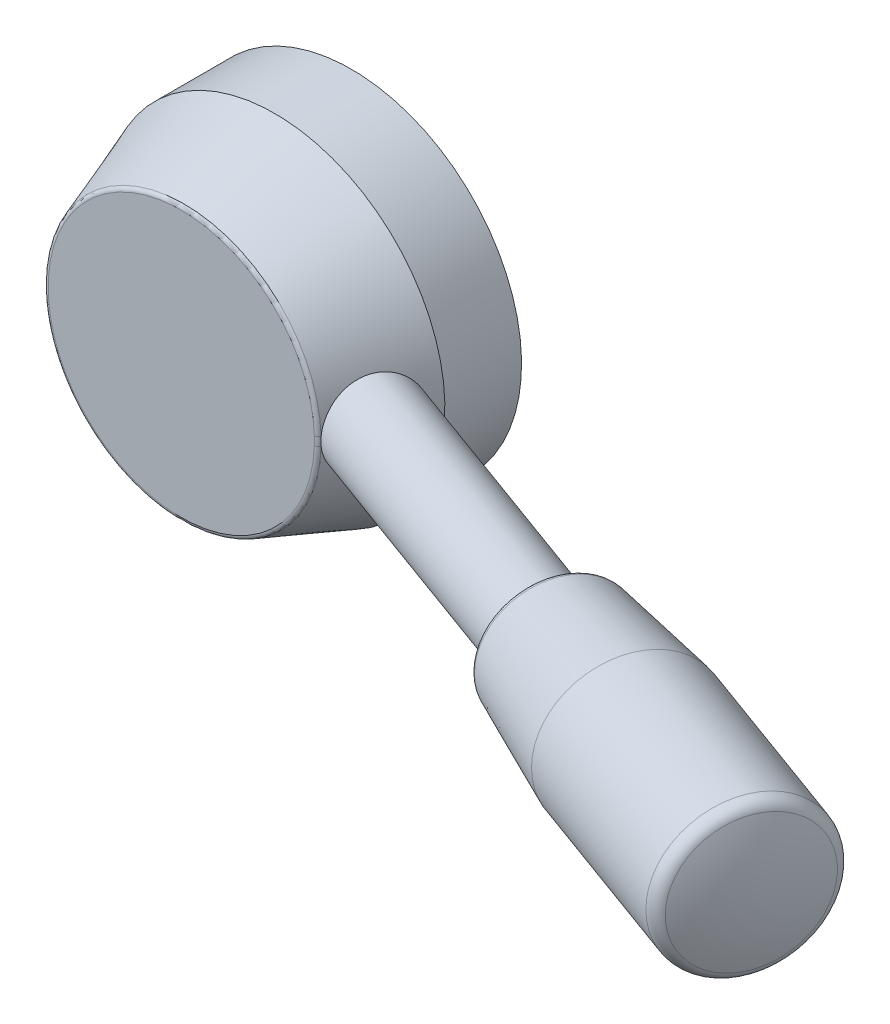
ISO-10303-21;
HEADER;
FILE_DESCRIPTION(('STEP AP214'),'2;1');
FILE_NAME('part.step','',(''),(''),'','','');
FILE_SCHEMA(('AUTOMOTIVE_DESIGN { 1 0 10303 214 1 1 1 1 }'));
ENDSEC;
DATA;
#1=APPLICATION_CONTEXT('core data for automotive mechanical design processes');
#2=APPLICATION_PROTOCOL_DEFINITION('international standard','automotive_design',2000,#1);
#3=PRODUCT_CONTEXT('',#1,'mechanical');
#4=PRODUCT('Part','Part','',(#3));
#5=PRODUCT_RELATED_PRODUCT_CATEGORY('part','',(#4));
#6=PRODUCT_DEFINITION_FORMATION('','',#4);
#7=PRODUCT_DEFINITION_CONTEXT('part definition',#1,'design');
#8=PRODUCT_DEFINITION('design','',#6,#7);
#9=PRODUCT_DEFINITION_SHAPE('','',#8);
#10=(LENGTH_UNIT() NAMED_UNIT(*) SI_UNIT(.MILLI.,.METRE.));
#11=(NAMED_UNIT(*) PLANE_ANGLE_UNIT() SI_UNIT($,.RADIAN.));
#12=(NAMED_UNIT(*) SI_UNIT($,.STERADIAN.) SOLID_ANGLE_UNIT());
#13=UNCERTAINTY_MEASURE_WITH_UNIT(LENGTH_MEASURE(1.E-05),#10,'distance_accuracy_value','');
#14=(GEOMETRIC_REPRESENTATION_CONTEXT(3) GLOBAL_UNCERTAINTY_ASSIGNED_CONTEXT((#13)) GLOBAL_UNIT_ASSIGNED_CONTEXT((#10,
#11,#12)) REPRESENTATION_CONTEXT('',''));
#15=CARTESIAN_POINT('',(0.,0.,0.));
#16=DIRECTION('',(0.,0.,1.));
#17=DIRECTION('',(1.,0.,0.));
#18=AXIS2_PLACEMENT_3D('',#15,#16,#17);
#19=CARTESIAN_POINT('',(0.,0.,19.3420201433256));
#20=DIRECTION('',(0.,0.,-1.));
#21=DIRECTION('',(0.,1.,0.));
#22=AXIS2_PLACEMENT_3D('',#19,#20,#21);
#23=CONICAL_SURFACE('',#22,16.2394850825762,0.349065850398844);
#24=CARTESIAN_POINT('',(0.,0.,9.01009032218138));
#25=DIRECTION('',(0.,0.,1.));
#26=DIRECTION('',(0.,-1.,0.));
#27=AXIS2_PLACEMENT_3D('',#24,#25,#26);
#28=CIRCLE('',#27,20.);
#29=CARTESIAN_POINT('',(0.,-20.,9.01009032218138));
#30=VERTEX_POINT('',#29);
#31=EDGE_CURVE('E144',#30,#30,#28,.T.);
#32=ORIENTED_EDGE('',*,*,#31,.T.);
#33=EDGE_LOOP('',(#32));
#34=FACE_BOUND('',#33,.T.);
#35=CARTESIAN_POINT('',(18.8096263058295,3.38928122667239,11.4483606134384));
#36=CARTESIAN_POINT('',(18.7106112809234,3.59614483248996,11.6153012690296));
#37=CARTESIAN_POINT('',(18.6046550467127,3.78684364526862,11.7982940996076));
#38=CARTESIAN_POINT('',(18.3843331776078,4.13075217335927,12.1924584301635));
#39=CARTESIAN_POINT('',(18.2699630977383,4.28394188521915,12.4036448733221));
#40=CARTESIAN_POINT('',(18.0385177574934,4.54850790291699,12.8497150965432));
#41=CARTESIAN_POINT('',(17.9214407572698,4.65985647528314,13.0846144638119));
#42=CARTESIAN_POINT('',(17.6904441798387,4.83706101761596,13.5724031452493));
#43=CARTESIAN_POINT('',(17.5765237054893,4.90293004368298,13.8252872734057));
#44=CARTESIAN_POINT('',(17.3591470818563,4.98612783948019,14.3376834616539));
#45=CARTESIAN_POINT('',(17.255537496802,5.00432349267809,14.596989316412));
#46=CARTESIAN_POINT('',(17.0605799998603,4.99394605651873,15.1192309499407));
#47=CARTESIAN_POINT('',(16.9692302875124,4.96537984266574,15.3821661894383));
#48=CARTESIAN_POINT('',(16.8035502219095,4.86373578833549,15.8972647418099));
#49=CARTESIAN_POINT('',(16.7288532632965,4.79178201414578,16.1495333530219));
#50=CARTESIAN_POINT('',(16.5945661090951,4.60665437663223,16.6426924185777));
#51=CARTESIAN_POINT('',(16.5349772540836,4.49347685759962,16.8835818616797));
#52=CARTESIAN_POINT('',(16.4296976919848,4.22751597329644,17.350119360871));
#53=CARTESIAN_POINT('',(16.3842022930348,4.07422605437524,17.575522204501));
#54=CARTESIAN_POINT('',(16.3064906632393,3.73297458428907,18.0009701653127));
#55=CARTESIAN_POINT('',(16.2742774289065,3.54500522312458,18.2010095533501));
#56=CARTESIAN_POINT('',(16.2198686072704,3.13232504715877,18.5758556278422));
#57=CARTESIAN_POINT('',(16.1980421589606,2.90659951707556,18.7496007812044));
#58=CARTESIAN_POINT('',(16.1631824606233,2.42898195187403,19.0575568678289));
#59=CARTESIAN_POINT('',(16.1501490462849,2.17709040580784,19.1917685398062));
#60=CARTESIAN_POINT('',(16.1302714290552,1.65434636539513,19.4152433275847));
#61=CARTESIAN_POINT('',(16.1234161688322,1.38352868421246,19.5045866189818));
#62=CARTESIAN_POINT('',(16.1139084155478,0.830419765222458,19.6347431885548));
#63=CARTESIAN_POINT('',(16.1112547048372,0.548131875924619,19.6755705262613));
#64=CARTESIAN_POINT('',(16.1092377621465,-0.00891456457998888,19.7062401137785));
#65=CARTESIAN_POINT('',(16.1097587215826,-0.283575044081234,19.6978771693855));
#66=CARTESIAN_POINT('',(16.1140091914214,-0.827456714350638,19.634717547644));
#67=CARTESIAN_POINT('',(16.1177385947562,-1.09667808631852,19.5799224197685));
#68=CARTESIAN_POINT('',(16.1295104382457,-1.6194157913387,19.4270534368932));
#69=CARTESIAN_POINT('',(16.1375088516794,-1.8730634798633,19.3294231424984));
#70=CARTESIAN_POINT('',(16.1596753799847,-2.36112466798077,19.0947485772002));
#71=CARTESIAN_POINT('',(16.1738446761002,-2.59553447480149,18.9576967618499));
#72=CARTESIAN_POINT('',(16.2113006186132,-3.04672110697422,18.6438181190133));
#73=CARTESIAN_POINT('',(16.2348694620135,-3.26267385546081,18.4658401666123));
#74=CARTESIAN_POINT('',(16.2937987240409,-3.66266387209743,18.0786596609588));
#75=CARTESIAN_POINT('',(16.3291610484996,-3.84669597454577,17.8694520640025));
#76=CARTESIAN_POINT('',(16.4150442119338,-4.18177206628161,17.4211489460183));
#77=CARTESIAN_POINT('',(16.4658920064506,-4.33196910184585,17.1814811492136));
#78=CARTESIAN_POINT('',(16.5840742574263,-4.58927420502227,16.6837804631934));
#79=CARTESIAN_POINT('',(16.6514054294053,-4.69639084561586,16.4257512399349));
#80=CARTESIAN_POINT('',(16.8009614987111,-4.86200191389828,15.9056427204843));
#81=CARTESIAN_POINT('',(16.8828079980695,-4.9215585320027,15.6437932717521));
#82=CARTESIAN_POINT('',(17.0608043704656,-4.99404706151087,15.1185268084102));
#83=CARTESIAN_POINT('',(17.1569519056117,-5.00698658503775,14.8551100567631));
#84=CARTESIAN_POINT('',(17.3574833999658,-4.98617572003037,14.3417740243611));
#85=CARTESIAN_POINT('',(17.4615652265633,-4.95370942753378,14.0916829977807));
#86=CARTESIAN_POINT('',(17.6760495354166,-4.84552718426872,13.6038882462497));
#87=CARTESIAN_POINT('',(17.7864524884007,-4.76980800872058,13.3661854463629));
#88=CARTESIAN_POINT('',(18.010054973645,-4.57635477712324,12.9060550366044));
#89=CARTESIAN_POINT('',(18.1232721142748,-4.4581392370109,12.6838388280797));
#90=CARTESIAN_POINT('',(18.3459937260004,-4.1832267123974,12.2625448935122));
#91=CARTESIAN_POINT('',(18.4554975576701,-4.02652313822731,12.063471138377));
#92=CARTESIAN_POINT('',(18.6687487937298,-3.67347260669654,11.6869264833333));
#93=CARTESIAN_POINT('',(18.7722241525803,-3.47607542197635,11.5102850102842));
#94=CARTESIAN_POINT('',(18.9643378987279,-3.04998444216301,11.1896616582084));
#95=CARTESIAN_POINT('',(19.0529755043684,-2.82128899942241,11.0456814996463));
#96=CARTESIAN_POINT('',(19.2110746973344,-2.33723383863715,10.7929308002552));
#97=CARTESIAN_POINT('',(19.2804200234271,-2.08172471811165,10.6843730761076));
#98=CARTESIAN_POINT('',(19.3952123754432,-1.55236166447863,10.5064174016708));
#99=CARTESIAN_POINT('',(19.4406634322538,-1.27851083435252,10.4370128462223));
#100=CARTESIAN_POINT('',(19.5042063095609,-0.726830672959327,10.3403592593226));
#101=CARTESIAN_POINT('',(19.5228910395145,-0.449229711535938,10.3121963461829));
#102=CARTESIAN_POINT('',(19.5336983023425,0.107669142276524,10.2958804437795));
#103=CARTESIAN_POINT('',(19.5258217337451,0.386966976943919,10.3077261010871));
#104=CARTESIAN_POINT('',(19.4843554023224,0.9341592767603,10.3705257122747));
#105=CARTESIAN_POINT('',(19.4512176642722,1.20216774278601,10.4207922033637));
#106=CARTESIAN_POINT('',(19.3616577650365,1.7243639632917,10.5582819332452));
#107=CARTESIAN_POINT('',(19.3052439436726,1.97855663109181,10.6454919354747));
#108=CARTESIAN_POINT('',(19.1807931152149,2.43506808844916,10.8412429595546));
#109=CARTESIAN_POINT('',(19.1151765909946,2.63985774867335,10.945610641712));
#110=CARTESIAN_POINT('',(18.9712185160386,3.0300021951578,11.1789884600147));
#111=CARTESIAN_POINT('',(18.8928757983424,3.21535519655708,11.3080008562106));
#112=CARTESIAN_POINT('',(18.8096263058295,3.38928122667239,11.4483606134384));
#113=B_SPLINE_CURVE_WITH_KNOTS('',3,(#35,#36,#37,#38,#39,#40,#41,#42,#43,#44,#45,#46,#47,#48,
#49,#50,#51,#52,#53,#54,#55,#56,#57,#58,#59,#60,#61,#62,#63,#64,#65,#66,#67,#68,#69,#70,#71,#72,
#73,#74,#75,#76,#77,#78,#79,#80,#81,#82,#83,#84,#85,#86,#87,#88,#89,#90,#91,#92,#93,#94,#95,#96,
#97,#98,#99,#100,#101,#102,#103,#104,#105,#106,#107,#108,#109,#110,#111,#112),.UNSPECIFIED.,.T.,
.F.,(4,2,2,2,2,2,2,2,2,2,2,2,2,2,2,2,2,2,2,2,2,2,2,2,2,2,2,2,2,2,2,2,2,2,2,2,2,2,4),(0.,
0.850150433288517,1.70075326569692,2.55191891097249,3.40284010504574,4.23817734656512,
5.07339177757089,5.88784545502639,6.70237137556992,7.52772639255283,8.35326751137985,
9.2062876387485,10.0592918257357,10.9107663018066,11.7619939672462,12.5823602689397,
13.4026991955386,14.2147368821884,15.026930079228,15.8656037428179,16.7044130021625,
17.5623300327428,18.4200762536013,19.2580836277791,20.0959541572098,20.9106026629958,
21.7253119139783,22.5495588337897,23.3739469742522,24.223120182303,25.0723381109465,
25.926567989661,26.7806537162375,27.6155111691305,28.4503403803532,29.2705719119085,
30.0905098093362,30.8052306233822,31.5200170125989),.UNSPECIFIED.);
#114=CARTESIAN_POINT('',(16.111567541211,-0.513313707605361,19.6710100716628));
#115=VERTEX_POINT('',#114);
#116=CARTESIAN_POINT('',(16.111567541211,0.513313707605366,19.6710100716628));
#117=VERTEX_POINT('',#116);
#118=EDGE_CURVE('E145',#115,#117,#113,.T.);
#119=ORIENTED_EDGE('',*,*,#118,.F.);
#120=CARTESIAN_POINT('',(0.,0.,19.6710100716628));
#121=DIRECTION('',(0.,0.,-1.));
#122=DIRECTION('',(0.,1.,0.));
#123=AXIS2_PLACEMENT_3D('',#120,#121,#122);
#124=CIRCLE('',#123,16.1197425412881);
#125=EDGE_CURVE('E9',#115,#117,#124,.T.);
#126=ORIENTED_EDGE('',*,*,#125,.T.);
#127=EDGE_LOOP('',(#119,#126));
#128=FACE_BOUND('',#127,.T.);
#129=ADVANCED_FACE('F14',(#34,#128),#23,.T.);
#130=CARTESIAN_POINT('',(-4.,0.,13.));
#131=DIRECTION('',(0.,0.,-1.));
#132=DIRECTION('',(0.,1.,0.));
#133=AXIS2_PLACEMENT_3D('',#130,#131,#132);
#134=PLANE('',#133);
#135=CARTESIAN_POINT('',(0.,0.,13.));
#136=DIRECTION('',(0.,0.,1.));
#137=DIRECTION('',(0.,-1.,0.));
#138=AXIS2_PLACEMENT_3D('',#135,#136,#137);
#139=CIRCLE('',#138,4.);
#140=CARTESIAN_POINT('',(0.,-4.,13.));
#141=VERTEX_POINT('',#140);
#142=EDGE_CURVE('E147',#141,#141,#139,.T.);
#143=ORIENTED_EDGE('',*,*,#142,.F.);
#144=EDGE_LOOP('',(#143));
#145=FACE_BOUND('',#144,.T.);
#146=ADVANCED_FACE('F135',(#145),#134,.T.);
#147=CARTESIAN_POINT('',(0.,0.,25.));
#148=DIRECTION('',(0.,0.,1.));
#149=DIRECTION('',(0.,-1.,0.));
#150=AXIS2_PLACEMENT_3D('',#147,#148,#149);
#151=CYLINDRICAL_SURFACE('',#150,4.);
#152=CARTESIAN_POINT('',(0.,0.,0.));
#153=DIRECTION('',(0.,0.,1.));
#154=DIRECTION('',(0.,-1.,0.));
#155=AXIS2_PLACEMENT_3D('',#152,#153,#154);
#156=CIRCLE('',#155,4.);
#157=CARTESIAN_POINT('',(0.,-4.,0.));
#158=VERTEX_POINT('',#157);
#159=EDGE_CURVE('E154',#158,#158,#156,.T.);
#160=ORIENTED_EDGE('',*,*,#159,.F.);
#161=EDGE_LOOP('',(#160));
#162=FACE_BOUND('',#161,.T.);
#163=ORIENTED_EDGE('',*,*,#142,.T.);
#164=EDGE_LOOP('',(#163));
#165=FACE_BOUND('',#164,.T.);
#166=ADVANCED_FACE('F140',(#162,#165),#151,.F.);
#167=CARTESIAN_POINT('',(-20.,0.,0.));
#168=DIRECTION('',(0.,0.,-1.));
#169=DIRECTION('',(0.,1.,0.));
#170=AXIS2_PLACEMENT_3D('',#167,#168,#169);
#171=PLANE('',#170);
#172=ORIENTED_EDGE('',*,*,#159,.T.);
#173=EDGE_LOOP('',(#172));
#174=FACE_BOUND('',#173,.T.);
#175=CARTESIAN_POINT('',(0.,0.,0.));
#176=DIRECTION('',(0.,0.,1.));
#177=DIRECTION('',(0.,-1.,0.));
#178=AXIS2_PLACEMENT_3D('',#175,#176,#177);
#179=CIRCLE('',#178,20.);
#180=CARTESIAN_POINT('',(0.,-20.,0.));
#181=VERTEX_POINT('',#180);
#182=EDGE_CURVE('E157',#181,#181,#179,.T.);
#183=ORIENTED_EDGE('',*,*,#182,.F.);
#184=EDGE_LOOP('',(#183));
#185=FACE_BOUND('',#184,.T.);
#186=ADVANCED_FACE('F188',(#174,#185),#171,.T.);
#187=CARTESIAN_POINT('',(0.,0.,25.));
#188=DIRECTION('',(0.,0.,1.));
#189=DIRECTION('',(0.,-1.,0.));
#190=AXIS2_PLACEMENT_3D('',#187,#188,#189);
#191=CYLINDRICAL_SURFACE('',#190,20.);
#192=ORIENTED_EDGE('',*,*,#182,.T.);
#193=EDGE_LOOP('',(#192));
#194=FACE_BOUND('',#193,.T.);
#195=ORIENTED_EDGE('',*,*,#31,.F.);
#196=EDGE_LOOP('',(#195));
#197=FACE_BOUND('',#196,.T.);
#198=ADVANCED_FACE('F66',(#194,#197),#191,.T.);
#199=CARTESIAN_POINT('',(-15.2997924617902,0.,20.));
#200=DIRECTION('',(0.,0.,1.));
#201=DIRECTION('',(0.,-1.,0.));
#202=AXIS2_PLACEMENT_3D('',#199,#200,#201);
#203=PLANE('',#202);
#204=CARTESIAN_POINT('',(0.,0.,20.));
#205=DIRECTION('',(0.,0.,1.));
#206=DIRECTION('',(0.,-1.,0.));
#207=AXIS2_PLACEMENT_3D('',#204,#205,#206);
#208=CIRCLE('',#207,15.6498962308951);
#209=CARTESIAN_POINT('',(15.641959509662,0.498352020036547,20.));
#210=VERTEX_POINT('',#209);
#211=CARTESIAN_POINT('',(15.641959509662,-0.498352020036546,20.));
#212=VERTEX_POINT('',#211);
#213=EDGE_CURVE('E50',#210,#212,#208,.T.);
#214=ORIENTED_EDGE('',*,*,#213,.T.);
#215=CARTESIAN_POINT('',(16.177433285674,2.64587121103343,20.));
#216=CARTESIAN_POINT('',(16.1550419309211,2.2603785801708,20.));
#217=CARTESIAN_POINT('',(16.1493813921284,2.16292596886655,19.6264000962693));
#218=CARTESIAN_POINT('',(16.1437208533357,2.06547335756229,19.2528001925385));
#219=CARTESIAN_POINT('',(16.1632502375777,2.40169391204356,19.0639079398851));
#220=CARTESIAN_POINT('',(16.1700840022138,2.64629949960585,20.));
#221=CARTESIAN_POINT('',(16.1592972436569,2.26011994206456,20.));
#222=CARTESIAN_POINT('',(16.1565700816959,2.16249610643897,19.6263986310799));
#223=CARTESIAN_POINT('',(16.1538425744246,2.06487308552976,19.2527975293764));
#224=CARTESIAN_POINT('',(16.1632503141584,2.40169500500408,19.0639072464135));
#225=CARTESIAN_POINT('',(16.162719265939,2.64639253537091,20.));
#226=CARTESIAN_POINT('',(16.1635621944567,2.26018210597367,20.));
#227=CARTESIAN_POINT('',(16.1637707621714,2.16244960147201,19.626527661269));
#228=CARTESIAN_POINT('',(16.1639764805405,2.0647171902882,19.2530552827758));
#229=CARTESIAN_POINT('',(16.1632369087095,2.40146427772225,19.0640369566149));
#230=CARTESIAN_POINT('',(16.1480170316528,2.6459217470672,20.));
#231=CARTESIAN_POINT('',(16.171844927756,2.26086969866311,20.));
#232=CARTESIAN_POINT('',(16.177894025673,2.16303996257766,19.6270337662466));
#233=CARTESIAN_POINT('',(16.1839402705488,2.06520989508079,19.2540673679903));
#234=CARTESIAN_POINT('',(16.1631839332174,2.4005510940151,19.0645498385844));
#235=CARTESIAN_POINT('',(16.1406795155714,2.64535849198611,20.));
#236=CARTESIAN_POINT('',(16.1758613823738,2.2614942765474,20.));
#237=CARTESIAN_POINT('',(16.1848168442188,2.16367623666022,19.6274106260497));
#238=CARTESIAN_POINT('',(16.1937665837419,2.06585737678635,19.2548208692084));
#239=CARTESIAN_POINT('',(16.1631443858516,2.39986902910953,19.0649327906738));
#240=CARTESIAN_POINT('',(16.118912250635,2.64272149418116,20.));
#241=CARTESIAN_POINT('',(16.187075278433,2.26407541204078,20.));
#242=CARTESIAN_POINT('',(16.204611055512,2.1664669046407,19.6288846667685));
#243=CARTESIAN_POINT('',(16.2221272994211,2.06885566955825,19.2577677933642));
#244=CARTESIAN_POINT('',(16.1629886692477,2.39717992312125,19.0664413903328));
#245=CARTESIAN_POINT('',(16.1045885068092,2.63970789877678,20.));
#246=CARTESIAN_POINT('',(16.1935295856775,2.26673520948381,20.));
#247=CARTESIAN_POINT('',(16.2166535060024,2.16949832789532,19.630325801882));
#248=CARTESIAN_POINT('',(16.2397488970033,2.07225088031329,19.2606463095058));
#249=CARTESIAN_POINT('',(16.1628353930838,2.39452947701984,19.0679270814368));
#250=CARTESIAN_POINT('',(16.0766576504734,2.63148099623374,20.));
#251=CARTESIAN_POINT('',(16.2032793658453,2.27266571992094,20.));
#252=CARTESIAN_POINT('',(16.2371338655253,2.17654355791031,19.633916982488));
#253=CARTESIAN_POINT('',(16.2709587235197,2.08041194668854,19.2678290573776));
#254=CARTESIAN_POINT('',(16.1624445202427,2.38773374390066,19.0717234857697));
#255=CARTESIAN_POINT('',(16.0630484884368,2.62627441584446,20.));
#256=CARTESIAN_POINT('',(16.2065878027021,2.27592949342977,20.));
#257=CARTESIAN_POINT('',(16.2455826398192,2.18055434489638,19.6360648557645));
#258=CARTESIAN_POINT('',(16.2845528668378,2.08516515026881,19.2721208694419));
#259=CARTESIAN_POINT('',(16.1622071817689,2.38359303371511,19.0740316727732));
#260=CARTESIAN_POINT('',(16.0366638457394,2.61402081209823,20.));
#261=CARTESIAN_POINT('',(16.2100965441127,2.28185394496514,20.));
#262=CARTESIAN_POINT('',(16.2588824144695,2.18824976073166,19.6408438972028));
#263=CARTESIAN_POINT('',(16.3076431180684,2.09463082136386,19.2816787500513));
#264=CARTESIAN_POINT('',(16.1616642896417,2.37405515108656,19.0793252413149));
#265=CARTESIAN_POINT('',(16.0238903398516,2.60696961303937,20.));
#266=CARTESIAN_POINT('',(16.2103001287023,2.28451338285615,20.));
#267=CARTESIAN_POINT('',(16.263725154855,2.19193362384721,19.6434761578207));
#268=CARTESIAN_POINT('',(16.3171369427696,2.09933996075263,19.2869399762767));
#269=CARTESIAN_POINT('',(16.1613585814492,2.36865513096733,19.0823121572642));
#270=CARTESIAN_POINT('',(15.990753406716,2.58602250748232,20.));
#271=CARTESIAN_POINT('',(16.2074330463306,2.28981251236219,20.));
#272=CARTESIAN_POINT('',(16.2726604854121,2.20025223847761,19.6509463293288));
#273=CARTESIAN_POINT('',(16.3378455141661,2.11065513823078,19.3018593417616));
#274=CARTESIAN_POINT('',(16.1604664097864,2.35276355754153,19.0910563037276));
#275=CARTESIAN_POINT('',(15.9712519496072,2.57076588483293,20.));
#276=CARTESIAN_POINT('',(16.2020369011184,2.29119913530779,20.));
#277=CARTESIAN_POINT('',(16.2739168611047,2.20378199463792,19.6560504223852));
#278=CARTESIAN_POINT('',(16.3458073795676,2.11635841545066,19.3120605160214));
#279=CARTESIAN_POINT('',(16.1598320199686,2.34133393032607,19.097300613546));
#280=CARTESIAN_POINT('',(15.9348221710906,2.53743449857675,20.));
#281=CARTESIAN_POINT('',(16.1873196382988,2.28903716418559,20.));
#282=CARTESIAN_POINT('',(16.2712327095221,2.20616242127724,19.6664726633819));
#283=CARTESIAN_POINT('',(16.3551563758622,2.12327537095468,19.3329035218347));
#284=CARTESIAN_POINT('',(16.1584752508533,2.31645907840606,19.1107416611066));
#285=CARTESIAN_POINT('',(15.9179019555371,2.51935120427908,20.));
#286=CARTESIAN_POINT('',(16.1780185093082,2.28551235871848,20.));
#287=CARTESIAN_POINT('',(16.2672761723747,2.20499865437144,19.6717914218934));
#288=CARTESIAN_POINT('',(16.356574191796,2.1245099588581,19.3435415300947));
#289=CARTESIAN_POINT('',(16.1577526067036,2.3030077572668,19.1179412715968));
#290=CARTESIAN_POINT('',(15.8883636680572,2.48374855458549,20.));
#291=CARTESIAN_POINT('',(16.159064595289,2.27492674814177,20.));
#292=CARTESIAN_POINT('',(16.2573455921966,2.19891496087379,19.6816887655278));
#293=CARTESIAN_POINT('',(16.3556590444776,2.12292280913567,19.3633461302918));
#294=CARTESIAN_POINT('',(16.1563551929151,2.27649251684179,19.1319615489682));
#295=CARTESIAN_POINT('',(15.8754721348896,2.46645199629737,20.));
#296=CARTESIAN_POINT('',(16.1496242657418,2.26840224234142,20.));
#297=CARTESIAN_POINT('',(16.2516936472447,2.19449359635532,19.6862751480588));
#298=CARTESIAN_POINT('',(16.353803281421,2.12062245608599,19.3725206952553));
#299=CARTESIAN_POINT('',(16.1556860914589,2.26359842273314,19.1387132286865));
#300=CARTESIAN_POINT('',(15.8512251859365,2.43080637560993,20.));
#301=CARTESIAN_POINT('',(16.1303522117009,2.25266668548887,20.));
#302=CARTESIAN_POINT('',(16.2393226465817,2.1829532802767,19.6953169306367));
#303=CARTESIAN_POINT('',(16.3483337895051,2.11327789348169,19.3906042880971));
#304=CARTESIAN_POINT('',(16.154327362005,2.2369480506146,19.1525117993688));
#305=CARTESIAN_POINT('',(15.8398709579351,2.41245651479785,20.));
#306=CARTESIAN_POINT('',(16.1205201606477,2.24346896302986,20.));
#307=CARTESIAN_POINT('',(16.2326027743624,2.17583225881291,19.6997722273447));
#308=CARTESIAN_POINT('',(16.3447294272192,2.10824846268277,19.3995172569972));
#309=CARTESIAN_POINT('',(16.153637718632,2.22319111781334,19.1595589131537));
#310=CARTESIAN_POINT('',(15.8078114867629,2.35624800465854,20.));
#311=CARTESIAN_POINT('',(16.0913048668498,2.21274573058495,20.));
#312=CARTESIAN_POINT('',(16.2118018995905,2.15116947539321,19.7128863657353));
#313=CARTESIAN_POINT('',(16.3324683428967,2.08979271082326,19.4256648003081));
#314=CARTESIAN_POINT('',(16.151555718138,2.18087428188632,19.1809775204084));
#315=CARTESIAN_POINT('',(15.7891187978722,2.317242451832,20.));
#316=CARTESIAN_POINT('',(16.0720059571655,2.18796338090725,20.));
#317=CARTESIAN_POINT('',(16.1970838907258,2.13033066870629,19.7212901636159));
#318=CARTESIAN_POINT('',(16.3223176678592,2.07295746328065,19.4424918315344));
#319=CARTESIAN_POINT('',(16.1501507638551,2.15127723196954,19.1956215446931));
#320=CARTESIAN_POINT('',(15.7553432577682,2.23613437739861,20.));
#321=CARTESIAN_POINT('',(16.0349935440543,2.13194189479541,20.));
#322=CARTESIAN_POINT('',(16.1677763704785,2.08197012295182,19.7376362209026));
#323=CARTESIAN_POINT('',(16.3007318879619,2.0322809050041,19.4751777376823));
#324=CARTESIAN_POINT('',(16.1473145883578,2.08904251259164,19.2256064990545));
#325=CARTESIAN_POINT('',(15.7404129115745,2.19397101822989,20.));
#326=CARTESIAN_POINT('',(16.0173034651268,2.10052193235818,20.));
#327=CARTESIAN_POINT('',(16.1532101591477,2.05423656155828,19.7455513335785));
#328=CARTESIAN_POINT('',(16.2892564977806,2.00825169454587,19.4910264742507));
#329=CARTESIAN_POINT('',(16.1458842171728,2.05633404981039,19.2409536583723));
#330=CARTESIAN_POINT('',(15.7140980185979,2.10851673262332,20.));
#331=CARTESIAN_POINT('',(15.9845856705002,2.0337910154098,20.));
#332=CARTESIAN_POINT('',(16.1255185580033,1.99444116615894,19.7606556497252));
#333=CARTESIAN_POINT('',(16.2665895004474,1.95539044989,19.5212360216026));
#334=CARTESIAN_POINT('',(16.1430763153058,1.98919289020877,19.2715373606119));
#335=CARTESIAN_POINT('',(15.7027177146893,2.06522452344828,20.));
#336=CARTESIAN_POINT('',(15.969515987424,1.99847614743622,20.));
#337=CARTESIAN_POINT('',(16.1123949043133,1.96237421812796,19.7678439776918));
#338=CARTESIAN_POINT('',(16.255382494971,1.92657039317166,19.5356270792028));
#339=CARTESIAN_POINT('',(16.1416988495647,1.95475818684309,19.2867737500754));
#340=CARTESIAN_POINT('',(15.6828022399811,1.97783814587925,20.));
#341=CARTESIAN_POINT('',(15.9419099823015,1.92510490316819,20.));
#342=CARTESIAN_POINT('',(16.0877869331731,1.89505681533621,19.7815801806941));
#343=CARTESIAN_POINT('',(16.2337733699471,1.86530742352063,19.5630994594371));
#344=CARTESIAN_POINT('',(16.1390109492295,1.88432347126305,19.3169600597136));
#345=CARTESIAN_POINT('',(15.6742777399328,1.93374160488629,20.));
#346=CARTESIAN_POINT('',(15.9293464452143,1.88702499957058,20.));
#347=CARTESIAN_POINT('',(16.0763088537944,1.8597950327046,19.7881255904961));
#348=CARTESIAN_POINT('',(16.22335601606,1.8328517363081,19.5762016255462));
#349=CARTESIAN_POINT('',(16.1377007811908,1.84831814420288,19.3319087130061));
#350=CARTESIAN_POINT('',(15.6596126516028,1.84520734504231,20.));
#351=CARTESIAN_POINT('',(15.906581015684,1.80906474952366,20.));
#352=CARTESIAN_POINT('',(16.0550403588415,1.78702672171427,19.8006034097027));
#353=CARTESIAN_POINT('',(16.2035819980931,1.76527354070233,19.6011583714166));
#354=CARTESIAN_POINT('',(16.1351638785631,1.77505657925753,19.3612949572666));
#355=CARTESIAN_POINT('',(15.6534697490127,1.80077000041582,20.));
#356=CARTESIAN_POINT('',(15.8963489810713,1.76916773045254,20.));
#357=CARTESIAN_POINT('',(16.0452483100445,1.74952241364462,19.8065364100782));
#358=CARTESIAN_POINT('',(16.1942078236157,1.73014626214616,19.6130342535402));
#359=CARTESIAN_POINT('',(16.1339370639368,1.73780159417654,19.3757330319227));
#360=CARTESIAN_POINT('',(15.6360275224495,1.65071195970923,20.));
#361=CARTESIAN_POINT('',(15.865512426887,1.63324781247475,20.));
#362=CARTESIAN_POINT('',(16.0149051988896,1.62031605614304,19.8255969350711));
#363=CARTESIAN_POINT('',(16.1646537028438,1.60886889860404,19.6509721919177));
#364=CARTESIAN_POINT('',(16.1299519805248,1.61031813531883,19.4233283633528));
#365=CARTESIAN_POINT('',(15.6291757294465,1.54458227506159,20.));
#366=CARTESIAN_POINT('',(15.8493341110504,1.53339902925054,20.));
#367=CARTESIAN_POINT('',(15.9979685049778,1.52468098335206,19.8374591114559));
#368=CARTESIAN_POINT('',(16.1467769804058,1.51718978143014,19.6747841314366));
#369=CARTESIAN_POINT('',(16.1273954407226,1.51736508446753,19.4550638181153));
#370=CARTESIAN_POINT('',(15.6220679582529,1.33207914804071,20.));
#371=CARTESIAN_POINT('',(15.825172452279,1.33034625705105,20.));
#372=CARTESIAN_POINT('',(15.970886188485,1.32793114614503,19.8585696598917));
#373=CARTESIAN_POINT('',(16.1167629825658,1.32673804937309,19.717010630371));
#374=CARTESIAN_POINT('',(16.1228040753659,1.32581836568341,19.5138482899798));
#375=CARTESIAN_POINT('',(15.6218205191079,1.22570556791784,20.));
#376=CARTESIAN_POINT('',(15.8170585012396,1.22684204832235,20.));
#377=CARTESIAN_POINT('',(15.96074937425,1.22680945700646,19.8678146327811));
#378=CARTESIAN_POINT('',(16.1045124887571,1.22772741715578,19.7355549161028));
#379=CARTESIAN_POINT('',(16.1207699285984,1.2272175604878,19.5408911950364));
#380=CARTESIAN_POINT('',(15.6247826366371,1.01263651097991,20.));
#381=CARTESIAN_POINT('',(15.8060094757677,1.01770166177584,20.));
#382=CARTESIAN_POINT('',(15.945237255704,1.02071049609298,19.883936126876));
#383=CARTESIAN_POINT('',(16.0845355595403,1.02466555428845,19.7677982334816));
#384=CARTESIAN_POINT('',(16.117217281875,1.02492346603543,19.5893672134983));
#385=CARTESIAN_POINT('',(15.6280048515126,0.905941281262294,20.));
#386=CARTESIAN_POINT('',(15.8030297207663,0.911772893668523,20.));
#387=CARTESIAN_POINT('',(15.9398795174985,0.915720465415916,19.8908038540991));
#388=CARTESIAN_POINT('',(16.0767550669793,0.920346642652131,19.781570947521));
#389=CARTESIAN_POINT('',(16.1157006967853,0.921212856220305,19.6107794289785));
#390=CARTESIAN_POINT('',(15.6352317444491,0.692642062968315,20.));
#391=CARTESIAN_POINT('',(15.7997738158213,0.698993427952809,20.));
#392=CARTESIAN_POINT('',(15.932191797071,0.703492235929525,19.9022249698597));
#393=CARTESIAN_POINT('',(16.0646330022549,0.708664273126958,19.8044139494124));
#394=CARTESIAN_POINT('',(16.1131828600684,0.710089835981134,19.6470100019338));
#395=CARTESIAN_POINT('',(15.6392360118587,0.586038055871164,20.));
#396=CARTESIAN_POINT('',(15.7994748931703,0.591871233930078,20.));
#397=CARTESIAN_POINT('',(15.9298602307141,0.596255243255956,19.9067795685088));
#398=CARTESIAN_POINT('',(16.060252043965,0.601045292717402,19.8135462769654));
#399=CARTESIAN_POINT('',(16.1121813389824,0.602679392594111,19.6618318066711));
#400=CARTESIAN_POINT('',(15.6458814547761,0.372635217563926,20.));
#401=CARTESIAN_POINT('',(15.7995969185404,0.376991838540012,20.));
#402=CARTESIAN_POINT('',(15.9267782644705,0.380233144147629,19.9136144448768));
#403=CARTESIAN_POINT('',(16.053964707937,0.383879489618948,19.827216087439));
#404=CARTESIAN_POINT('',(16.110680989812,0.385224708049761,19.6842608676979));
#405=CARTESIAN_POINT('',(15.648520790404,0.265836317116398,20.));
#406=CARTESIAN_POINT('',(15.8000162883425,0.268964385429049,20.));
#407=CARTESIAN_POINT('',(15.9260299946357,0.271446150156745,19.9158916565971));
#408=CARTESIAN_POINT('',(16.0520444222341,0.274062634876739,19.8317819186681));
#409=CARTESIAN_POINT('',(16.1101828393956,0.275177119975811,19.6918583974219));
#410=CARTESIAN_POINT('',(15.6511489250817,0.0521973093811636,20.));
#411=CARTESIAN_POINT('',(15.8004320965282,0.0529103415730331,20.));
#412=CARTESIAN_POINT('',(15.9252838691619,0.0533871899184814,19.9181601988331));
#413=CARTESIAN_POINT('',(16.0501358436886,0.05399903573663,19.8363189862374));
#414=CARTESIAN_POINT('',(16.1096865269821,0.0541991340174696,19.6994265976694));
#415=CARTESIAN_POINT('',(15.6511376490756,-0.0546427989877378,20.));
#416=CARTESIAN_POINT('',(15.8004295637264,-0.0553853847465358,20.));
#417=CARTESIAN_POINT('',(15.9252860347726,-0.0558847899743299,19.9181514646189));
#418=CARTESIAN_POINT('',(16.0501428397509,-0.0565213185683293,19.8363014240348));
#419=CARTESIAN_POINT('',(16.1096883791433,-0.0567312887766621,19.6993970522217));
#420=CARTESIAN_POINT('',(15.6484722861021,-0.268154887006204,20.));
#421=CARTESIAN_POINT('',(15.8000089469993,-0.271307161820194,20.));
#422=CARTESIAN_POINT('',(15.9260442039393,-0.273807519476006,19.9158492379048));
#423=CARTESIAN_POINT('',(16.052080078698,-0.276444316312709,19.8316970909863));
#424=CARTESIAN_POINT('',(16.1101917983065,-0.277566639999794,19.6917172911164));
#425=CARTESIAN_POINT('',(15.6458213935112,-0.374826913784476,20.));
#426=CARTESIAN_POINT('',(15.7995903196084,-0.379202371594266,20.));
#427=CARTESIAN_POINT('',(15.9267992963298,-0.382458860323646,19.9135585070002));
#428=CARTESIAN_POINT('',(16.0540128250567,-0.386121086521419,19.8271043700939));
#429=CARTESIAN_POINT('',(16.1106927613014,-0.387472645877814,19.6840762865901));
#430=CARTESIAN_POINT('',(15.6391615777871,-0.588128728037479,20.));
#431=CARTESIAN_POINT('',(15.7994784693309,-0.593974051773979,20.));
#432=CARTESIAN_POINT('',(15.9299007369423,-0.598364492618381,19.9066977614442));
#433=CARTESIAN_POINT('',(16.0603301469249,-0.60316295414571,19.8133823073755));
#434=CARTESIAN_POINT('',(16.1121992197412,-0.604795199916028,19.6615644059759));
#435=CARTESIAN_POINT('',(15.635152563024,-0.694758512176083,20.));
#436=CARTESIAN_POINT('',(15.7997879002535,-0.701118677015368,20.));
#437=CARTESIAN_POINT('',(15.9322471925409,-0.70561868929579,19.9021275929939));
#438=CARTESIAN_POINT('',(16.0647321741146,-0.710794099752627,19.8042180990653));
#439=CARTESIAN_POINT('',(16.1132047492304,-0.712211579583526,19.6466930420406));
#440=CARTESIAN_POINT('',(15.6298396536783,-0.851898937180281,20.));
#441=CARTESIAN_POINT('',(15.8022100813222,-0.857595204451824,20.));
#442=CARTESIAN_POINT('',(15.9379423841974,-0.861943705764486,19.8936893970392));
#443=CARTESIAN_POINT('',(16.0736797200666,-0.866444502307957,19.7873708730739));
#444=CARTESIAN_POINT('',(16.1150643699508,-0.867715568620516,19.6199369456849));
#445=CARTESIAN_POINT('',(15.6282228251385,-0.902398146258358,20.));
#446=CARTESIAN_POINT('',(15.8032929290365,-0.907834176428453,20.));
#447=CARTESIAN_POINT('',(15.9401129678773,-0.911916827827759,19.8907185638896));
#448=CARTESIAN_POINT('',(16.0769425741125,-0.91618022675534,19.781425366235));
#449=CARTESIAN_POINT('',(16.1157194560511,-0.91726357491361,19.6106021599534));
#450=CARTESIAN_POINT('',(15.6254512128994,-1.00341465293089,20.));
#451=CARTESIAN_POINT('',(15.8063161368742,-1.00792516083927,20.));
#452=CARTESIAN_POINT('',(15.9453244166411,-1.01122698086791,19.8842489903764));
#453=CARTESIAN_POINT('',(16.0843421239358,-1.01471002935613,19.7684861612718));
#454=CARTESIAN_POINT('',(16.1171467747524,-1.01541116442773,19.5905472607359));
#455=CARTESIAN_POINT('',(15.6242964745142,-1.05393195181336,20.));
#456=CARTESIAN_POINT('',(15.8082606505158,-1.05780655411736,20.));
#457=CARTESIAN_POINT('',(15.9483653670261,-1.06056394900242,19.8807501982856));
#458=CARTESIAN_POINT('',(16.0884843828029,-1.063530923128,19.7614845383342));
#459=CARTESIAN_POINT('',(16.1179190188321,-1.06401065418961,19.579827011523));
#460=CARTESIAN_POINT('',(15.6219572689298,-1.20565695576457,20.));
#461=CARTESIAN_POINT('',(15.8158052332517,-1.20719895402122,20.));
#462=CARTESIAN_POINT('',(15.9590926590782,-1.20756203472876,19.8694313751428));
#463=CARTESIAN_POINT('',(16.1024440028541,-1.20877350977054,19.7387968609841));
#464=CARTESIAN_POINT('',(16.1204144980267,-1.20837312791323,19.5456882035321));
#465=CARTESIAN_POINT('',(15.6219046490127,-1.30688654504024,20.));
#466=CARTESIAN_POINT('',(15.8231233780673,-1.3058441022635,20.));
#467=CARTESIAN_POINT('',(15.9683791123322,-1.30405910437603,19.8607969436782));
#468=CARTESIAN_POINT('',(16.1137711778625,-1.3033565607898,19.7214832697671));
#469=CARTESIAN_POINT('',(16.1223146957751,-1.30254983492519,19.5203178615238));
#470=CARTESIAN_POINT('',(15.6276507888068,-1.5151009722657,20.));
#471=CARTESIAN_POINT('',(15.8453256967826,-1.50551205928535,20.));
#472=CARTESIAN_POINT('',(15.9936588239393,-1.49782280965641,19.84060610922));
#473=CARTESIAN_POINT('',(16.1421562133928,-1.49135246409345,19.6810828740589));
#474=CARTESIAN_POINT('',(16.1267151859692,-1.49123185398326,19.463613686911));
#475=CARTESIAN_POINT('',(15.63378596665,-1.62208225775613,20.));
#476=CARTESIAN_POINT('',(15.8607435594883,-1.60656682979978,20.));
#477=CARTESIAN_POINT('',(16.010006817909,-1.59481502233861,19.8289103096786));
#478=CARTESIAN_POINT('',(16.1596101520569,-1.58454790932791,19.6576053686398));
#479=CARTESIAN_POINT('',(16.1292436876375,-1.58544506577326,19.4320209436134));
#480=CARTESIAN_POINT('',(15.6508882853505,-1.78156949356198,20.));
#481=CARTESIAN_POINT('',(15.8920203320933,-1.75194729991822,20.));
#482=CARTESIAN_POINT('',(16.0410757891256,-1.73326122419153,19.8090791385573));
#483=CARTESIAN_POINT('',(16.1902119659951,-1.71495034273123,19.6181058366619));
#484=CARTESIAN_POINT('',(16.1334098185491,-1.72167043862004,19.3819487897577));
#485=CARTESIAN_POINT('',(15.657889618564,-1.83449087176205,20.));
#486=CARTESIAN_POINT('',(15.903893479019,-1.79965810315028,20.));
#487=CARTESIAN_POINT('',(16.0525017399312,-1.77817551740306,19.8020994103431));
#488=CARTESIAN_POINT('',(16.2012261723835,-1.75709634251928,19.6041305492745));
#489=CARTESIAN_POINT('',(16.1348583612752,-1.76616825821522,19.3648379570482));
#490=CARTESIAN_POINT('',(15.6752270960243,-1.9397750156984,20.));
#491=CARTESIAN_POINT('',(15.9308687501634,-1.89243239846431,20.));
#492=CARTESIAN_POINT('',(16.0777244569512,-1.86479478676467,19.7872883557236));
#493=CARTESIAN_POINT('',(16.224699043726,-1.83756093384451,19.5745069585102));
#494=CARTESIAN_POINT('',(16.1378715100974,-1.853329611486,19.3299179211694));
#495=CARTESIAN_POINT('',(15.6855611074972,-1.992138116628,20.));
#496=CARTESIAN_POINT('',(15.9460157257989,-1.93752969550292,20.));
#497=CARTESIAN_POINT('',(16.0915197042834,-1.90650179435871,19.7794575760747));
#498=CARTESIAN_POINT('',(16.2371847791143,-1.87589543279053,19.5588258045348));
#499=CARTESIAN_POINT('',(16.1394360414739,-1.89599429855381,19.3121091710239));
#500=CARTESIAN_POINT('',(15.7071521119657,-2.08204058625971,20.));
#501=CARTESIAN_POINT('',(15.975349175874,-2.01213798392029,20.));
#502=CARTESIAN_POINT('',(16.1174856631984,-1.97481281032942,19.7650495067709));
#503=CARTESIAN_POINT('',(16.2597089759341,-1.93771773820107,19.5300508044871));
#504=CARTESIAN_POINT('',(16.142233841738,-1.96813709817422,19.2808565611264));
#505=CARTESIAN_POINT('',(15.7174301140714,-2.11981342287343,20.));
#506=CARTESIAN_POINT('',(15.9887771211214,-2.04268821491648,20.));
#507=CARTESIAN_POINT('',(16.1291103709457,-2.00248067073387,19.7586939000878));
#508=CARTESIAN_POINT('',(16.2695511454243,-1.96250292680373,19.5173294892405));
#509=CARTESIAN_POINT('',(16.1434443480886,-1.99810066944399,19.2675135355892));
#510=CARTESIAN_POINT('',(15.7408009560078,-2.19467212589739,20.));
#511=CARTESIAN_POINT('',(16.0176888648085,-2.10089755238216,20.));
#512=CARTESIAN_POINT('',(16.1535177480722,-2.05457055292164,19.7453865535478));
#513=CARTESIAN_POINT('',(16.2894550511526,-2.00847461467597,19.4907136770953));
#514=CARTESIAN_POINT('',(16.1459115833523,-2.05684964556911,19.2406806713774));
#515=CARTESIAN_POINT('',(15.7539051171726,-2.23175455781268,20.));
#516=CARTESIAN_POINT('',(16.0332111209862,-2.12854203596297,20.));
#517=CARTESIAN_POINT('',(16.1663049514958,-2.07897886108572,19.7384324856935));
#518=CARTESIAN_POINT('',(16.2995276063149,-2.02963234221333,19.4767931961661));
#519=CARTESIAN_POINT('',(16.1471684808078,-2.08562974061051,19.2271904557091));
#520=CARTESIAN_POINT('',(15.7785520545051,-2.29230936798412,20.));
#521=CARTESIAN_POINT('',(16.0604476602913,-2.17080491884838,20.));
#522=CARTESIAN_POINT('',(16.1880238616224,-2.11564723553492,19.7263564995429));
#523=CARTESIAN_POINT('',(16.3156574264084,-2.06058696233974,19.452681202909));
#524=CARTESIAN_POINT('',(16.1492763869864,-2.1321728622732,19.2048570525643));
#525=CARTESIAN_POINT('',(15.7891406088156,-2.31616914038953,20.));
#526=CARTESIAN_POINT('',(16.0717319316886,-2.18671946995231,20.));
#527=CARTESIAN_POINT('',(16.1968077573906,-2.12923383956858,19.7214038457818));
#528=CARTESIAN_POINT('',(16.3219455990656,-2.07183530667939,19.4427716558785));
#529=CARTESIAN_POINT('',(16.1501219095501,-2.15038910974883,19.1959751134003));
#530=CARTESIAN_POINT('',(15.8120816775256,-2.363059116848,20.));
#531=CARTESIAN_POINT('',(16.0948464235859,-2.21602791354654,20.));
#532=CARTESIAN_POINT('',(16.2142429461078,-2.15375048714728,19.7112261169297));
#533=CARTESIAN_POINT('',(16.3337013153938,-2.09156013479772,19.4224159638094));
#534=CARTESIAN_POINT('',(16.1518124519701,-2.1859851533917,19.1783622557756));
#535=CARTESIAN_POINT('',(15.8244354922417,-2.38608869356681,20.));
#536=CARTESIAN_POINT('',(16.1066860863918,-2.22940837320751,20.));
#537=CARTESIAN_POINT('',(16.2228941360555,-2.16467855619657,19.7060008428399));
#538=CARTESIAN_POINT('',(16.3391649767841,-2.10001907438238,19.4119610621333));
#539=CARTESIAN_POINT('',(16.1526574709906,-2.20336432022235,19.1696314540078));
#540=CARTESIAN_POINT('',(15.8511027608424,-2.43079931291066,20.));
#541=CARTESIAN_POINT('',(16.1303031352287,-2.25279465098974,20.));
#542=CARTESIAN_POINT('',(16.2393049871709,-2.18307559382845,19.6953445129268));
#543=CARTESIAN_POINT('',(16.3483688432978,-2.1134261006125,19.3906486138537));
#544=CARTESIAN_POINT('',(16.1543261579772,-2.23695429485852,19.1525247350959));
#545=CARTESIAN_POINT('',(15.8654031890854,-2.452488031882,20.));
#546=CARTESIAN_POINT('',(16.1420861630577,-2.26280209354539,20.));
#547=CARTESIAN_POINT('',(16.2470699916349,-2.19056621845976,19.6899149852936));
#548=CARTESIAN_POINT('',(16.3521092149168,-2.11837323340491,19.3797854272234));
#549=CARTESIAN_POINT('',(16.1551499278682,-2.25317185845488,19.1441469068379));
#550=CARTESIAN_POINT('',(15.8963574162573,-2.49409143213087,20.));
#551=CARTESIAN_POINT('',(16.1646196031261,-2.27857429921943,20.));
#552=CARTESIAN_POINT('',(16.2605010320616,-2.20127446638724,19.6789097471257));
#553=CARTESIAN_POINT('',(16.3564350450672,-2.12401784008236,19.3577755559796));
#554=CARTESIAN_POINT('',(16.1567573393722,-2.28420483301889,19.1279164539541));
#555=CARTESIAN_POINT('',(15.9130063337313,-2.51400965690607,20.));
#556=CARTESIAN_POINT('',(16.1753678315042,-2.28431632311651,20.));
#557=CARTESIAN_POINT('',(16.266171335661,-2.20450081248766,19.6733343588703));
#558=CARTESIAN_POINT('',(16.3570022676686,-2.1246907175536,19.3466232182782));
#559=CARTESIAN_POINT('',(16.1575410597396,-2.29902304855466,19.1200627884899));
#560=CARTESIAN_POINT('',(15.9439110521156,-2.54597895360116,20.));
#561=CARTESIAN_POINT('',(16.1911613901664,-2.2898155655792,20.));
#562=CARTESIAN_POINT('',(16.2721021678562,-2.20578154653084,19.6638349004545));
#563=CARTESIAN_POINT('',(16.3530584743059,-2.12175124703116,19.3276460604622));
#564=CARTESIAN_POINT('',(16.1588219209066,-2.32283299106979,19.1073079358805));
#565=CARTESIAN_POINT('',(15.9575096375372,-2.55866067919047,20.));
#566=CARTESIAN_POINT('',(16.1969616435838,-2.29079297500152,20.));
#567=CARTESIAN_POINT('',(16.2734398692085,-2.2050417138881,19.6598902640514));
#568=CARTESIAN_POINT('',(16.3499155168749,-2.11927831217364,19.3197579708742));
#569=CARTESIAN_POINT('',(16.1593373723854,-2.33228644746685,19.1022004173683));
#570=CARTESIAN_POINT('',(15.9862417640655,-2.58220850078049,20.));
#571=CARTESIAN_POINT('',(16.2057780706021,-2.29004861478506,20.));
#572=CARTESIAN_POINT('',(16.272515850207,-2.20101859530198,19.6522088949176));
#573=CARTESIAN_POINT('',(16.3392507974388,-2.1119771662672,19.3043953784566));
#574=CARTESIAN_POINT('',(16.1603089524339,-2.34991627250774,19.0926113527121));
#575=CARTESIAN_POINT('',(16.0013764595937,-2.59307321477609,20.));
#576=CARTESIAN_POINT('',(16.2087744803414,-2.28830898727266,20.));
#577=CARTESIAN_POINT('',(16.2702514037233,-2.19773338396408,19.648472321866));
#578=CARTESIAN_POINT('',(16.3317013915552,-2.10713430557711,19.2969257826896));
#579=CARTESIAN_POINT('',(16.1607650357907,-2.35809166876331,19.0881302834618));
#580=CARTESIAN_POINT('',(16.0333740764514,-2.61247783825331,20.));
#581=CARTESIAN_POINT('',(16.2104989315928,-2.2827059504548,20.));
#582=CARTESIAN_POINT('',(16.2605009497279,-2.18932970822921,19.6414583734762));
#583=CARTESIAN_POINT('',(16.3104768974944,-2.09593126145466,19.2828974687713));
#584=CARTESIAN_POINT('',(16.1615956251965,-2.37285345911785,19.0799956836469));
#585=CARTESIAN_POINT('',(16.0502571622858,-2.62098518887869,20.));
#586=CARTESIAN_POINT('',(16.209145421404,-2.27880545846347,20.));
#587=CARTESIAN_POINT('',(16.2529464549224,-2.18418763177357,19.638187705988));
#588=CARTESIAN_POINT('',(16.2966975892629,-2.08954847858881,19.2763635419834));
#589=CARTESIAN_POINT('',(16.1619689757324,-2.37941746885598,19.0763538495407));
#590=CARTESIAN_POINT('',(16.0853198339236,-2.63460919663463,20.));
#591=CARTESIAN_POINT('',(16.2009666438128,-2.270788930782,20.));
#592=CARTESIAN_POINT('',(16.231537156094,-2.17423207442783,19.6326295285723));
#593=CARTESIAN_POINT('',(16.2620639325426,-2.07765300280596,19.2652466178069));
#594=CARTESIAN_POINT('',(16.1625878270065,-2.39023620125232,19.0703301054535));
#595=CARTESIAN_POINT('',(16.1034937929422,-2.63973967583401,20.));
#596=CARTESIAN_POINT('',(16.1941460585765,-2.26667875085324,20.));
#597=CARTESIAN_POINT('',(16.2177084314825,-2.16941732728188,19.6303380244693));
#598=CARTESIAN_POINT('',(16.2412333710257,-2.07214929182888,19.2606722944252));
#599=CARTESIAN_POINT('',(16.1628338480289,-2.39450032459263,19.0679430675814));
#600=CARTESIAN_POINT('',(16.1311268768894,-2.6443601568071,20.));
#601=CARTESIAN_POINT('',(16.1809216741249,-2.26252418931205,20.));
#602=CARTESIAN_POINT('',(16.1936504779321,-2.16476766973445,19.6280036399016));
#603=CARTESIAN_POINT('',(16.2063682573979,-2.06700871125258,19.2560062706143));
#604=CARTESIAN_POINT('',(16.1630819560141,-2.39879134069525,19.0655377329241));
#605=CARTESIAN_POINT('',(16.1403423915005,-2.64539065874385,20.));
#606=CARTESIAN_POINT('',(16.1760509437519,-2.26147609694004,20.));
#607=CARTESIAN_POINT('',(16.1851406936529,-2.1636457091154,19.6274096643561));
#608=CARTESIAN_POINT('',(16.1942249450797,-2.06581430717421,19.2548188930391));
#609=CARTESIAN_POINT('',(16.1631444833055,-2.39987050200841,19.0649320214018));
#610=CARTESIAN_POINT('',(16.1588569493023,-2.6464196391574,20.));
#611=CARTESIAN_POINT('',(16.1657983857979,-2.26023314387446,20.));
#612=CARTESIAN_POINT('',(16.16754658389,-2.16244501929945,19.6266076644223));
#613=CARTESIAN_POINT('',(16.1692890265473,-2.06465714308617,19.253215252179));
#614=CARTESIAN_POINT('',(16.1632285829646,-2.40132079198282,19.0641175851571));
#615=CARTESIAN_POINT('',(16.1681561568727,-2.64641512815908,20.));
#616=CARTESIAN_POINT('',(16.1604179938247,-2.26004169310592,20.));
#617=CARTESIAN_POINT('',(16.158460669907,-2.16236931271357,19.6264007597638));
#618=CARTESIAN_POINT('',(16.1565020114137,-2.06469910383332,19.2528022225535));
#619=CARTESIAN_POINT('',(16.1632500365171,-2.40168986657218,19.0639100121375));
#620=CARTESIAN_POINT('',(16.1774332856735,-2.64587121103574,20.));
#621=CARTESIAN_POINT('',(16.1550421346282,-2.26038206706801,20.));
#622=CARTESIAN_POINT('',(16.1493814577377,-2.16292707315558,19.6264043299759));
#623=CARTESIAN_POINT('',(16.1437207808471,-2.06547207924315,19.2528086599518));
#624=CARTESIAN_POINT('',(16.163249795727,-2.40168629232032,19.063912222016));
#625=(BOUNDED_SURFACE() B_SPLINE_SURFACE(3,2,((#215,#216,#217,#218,#219),(#220,#221,#222,#223,
#224),(#225,#226,#227,#228,#229),(#230,#231,#232,#233,#234),(#235,#236,#237,#238,#239),(#240,
#241,#242,#243,#244),(#245,#246,#247,#248,#249),(#250,#251,#252,#253,#254),(#255,#256,#257,#258,
#259),(#260,#261,#262,#263,#264),(#265,#266,#267,#268,#269),(#270,#271,#272,#273,#274),(#275,
#276,#277,#278,#279),(#280,#281,#282,#283,#284),(#285,#286,#287,#288,#289),(#290,#291,#292,#293,
#294),(#295,#296,#297,#298,#299),(#300,#301,#302,#303,#304),(#305,#306,#307,#308,#309),(#310,
#311,#312,#313,#314),(#315,#316,#317,#318,#319),(#320,#321,#322,#323,#324),(#325,#326,#327,#328,
#329),(#330,#331,#332,#333,#334),(#335,#336,#337,#338,#339),(#340,#341,#342,#343,#344),(#345,
#346,#347,#348,#349),(#350,#351,#352,#353,#354),(#355,#356,#357,#358,#359),(#360,#361,#362,#363,
#364),(#365,#366,#367,#368,#369),(#370,#371,#372,#373,#374),(#375,#376,#377,#378,#379),(#380,
#381,#382,#383,#384),(#385,#386,#387,#388,#389),(#390,#391,#392,#393,#394),(#395,#396,#397,#398,
#399),(#400,#401,#402,#403,#404),(#405,#406,#407,#408,#409),(#410,#411,#412,#413,#414),(#415,
#416,#417,#418,#419),(#420,#421,#422,#423,#424),(#425,#426,#427,#428,#429),(#430,#431,#432,#433,
#434),(#435,#436,#437,#438,#439),(#440,#441,#442,#443,#444),(#445,#446,#447,#448,#449),(#450,
#451,#452,#453,#454),(#455,#456,#457,#458,#459),(#460,#461,#462,#463,#464),(#465,#466,#467,#468,
#469),(#470,#471,#472,#473,#474),(#475,#476,#477,#478,#479),(#480,#481,#482,#483,#484),(#485,
#486,#487,#488,#489),(#490,#491,#492,#493,#494),(#495,#496,#497,#498,#499),(#500,#501,#502,#503,
#504),(#505,#506,#507,#508,#509),(#510,#511,#512,#513,#514),(#515,#516,#517,#518,#519),(#520,
#521,#522,#523,#524),(#525,#526,#527,#528,#529),(#530,#531,#532,#533,#534),(#535,#536,#537,#538,
#539),(#540,#541,#542,#543,#544),(#545,#546,#547,#548,#549),(#550,#551,#552,#553,#554),(#555,
#556,#557,#558,#559),(#560,#561,#562,#563,#564),(#565,#566,#567,#568,#569),(#570,#571,#572,#573,
#574),(#575,#576,#577,#578,#579),(#580,#581,#582,#583,#584),(#585,#586,#587,#588,#589),(#590,
#591,#592,#593,#594),(#595,#596,#597,#598,#599),(#600,#601,#602,#603,#604),(#605,#606,#607,#608,
#609),(#610,#611,#612,#613,#614),(#615,#616,#617,#618,#619),(#620,#621,#622,#623,#624)),
.UNSPECIFIED.,.F.,.F.,.F.) B_SPLINE_SURFACE_WITH_KNOTS((4,2,2,2,2,2,2,2,2,2,2,2,2,2,2,2,2,2,2,2,
2,2,2,2,2,2,2,2,2,2,2,2,2,2,2,2,2,2,2,2,4),(3,2,3),(0.,0.022070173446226,0.0441212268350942,
0.0878108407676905,0.131367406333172,0.175023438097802,0.248878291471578,0.32296049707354,
0.387583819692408,0.452256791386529,0.581647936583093,0.715653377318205,0.849818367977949,
0.984479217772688,1.11900888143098,1.43763908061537,1.75668123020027,2.07689128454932,
2.39693364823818,2.71740630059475,3.03788802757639,3.35798238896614,3.67809835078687,
3.82967243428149,3.98126137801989,4.28489324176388,4.60597304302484,4.76604397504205,
4.92601267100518,5.04337280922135,5.16121211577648,5.23946652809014,5.31777888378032,
5.39559085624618,5.47324341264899,5.52890845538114,5.58461564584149,5.64105770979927,
5.69726728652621,5.72503407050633,5.75288105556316),(0.,0.5,1.),
.UNSPECIFIED.) GEOMETRIC_REPRESENTATION_ITEM() RATIONAL_B_SPLINE_SURFACE(((1.,0.791454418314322,
1.,0.791454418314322,1.),(1.,0.791453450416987,1.,0.791453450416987,1.),(1.,0.791535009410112,
1.,0.791535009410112,1.),(1.,0.79185466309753,1.,0.79185466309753,1.),(1.,0.792092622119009,1.,
0.792092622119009,1.),(1.,0.793022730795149,1.,0.793022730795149,1.),(1.,0.793931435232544,1.,
0.793931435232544,1.),(1.,0.796189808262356,1.,0.796189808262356,1.),(1.,0.7975381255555,1.,
0.7975381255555,1.),(1.,0.800528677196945,1.,0.800528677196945,1.),(1.,0.802171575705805,1.,
0.802171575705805,1.),(1.,0.806817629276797,1.,0.806817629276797,1.),(1.,0.809975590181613,1.,
0.809975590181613,1.),(1.,0.816384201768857,1.,0.816384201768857,1.),(1.,0.819635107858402,1.,
0.819635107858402,1.),(1.,0.82564922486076,1.,0.82564922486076,1.),(1.,0.828421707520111,1.,
0.828421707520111,1.),(1.,0.833861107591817,1.,0.833861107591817,1.),(1.,0.836527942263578,1.,
0.836527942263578,1.),(1.,0.844342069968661,1.,0.844342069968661,1.),(1.,0.849300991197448,1.,
0.849300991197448,1.),(1.,0.85887136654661,1.,0.85887136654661,1.),(1.,0.863464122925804,1.,
0.863464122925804,1.),(1.,0.872166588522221,1.,0.872166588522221,1.),(1.,0.876275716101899,1.,
0.876275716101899,1.),(1.,0.884078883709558,1.,0.884078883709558,1.),(1.,0.887771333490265,1.,
0.887771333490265,1.),(1.,0.894771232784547,1.,0.894771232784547,1.),(1.,0.898079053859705,1.,
0.898079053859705,1.),(1.,0.90865443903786,1.,0.90865443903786,1.),(1.,0.915146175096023,1.,
0.915146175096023,1.),(1.,0.926607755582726,1.,0.926607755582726,1.),(1.,0.931575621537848,1.,
0.931575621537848,1.),(1.,0.940188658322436,1.,0.940188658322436,1.),(1.,0.943828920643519,1.,
0.943828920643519,1.),(1.,0.949859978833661,1.,0.949859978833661,1.),(1.,0.952251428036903,1.,
0.952251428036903,1.),(1.,0.955833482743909,1.,0.955833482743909,1.),(1.,0.957022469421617,1.,
0.957022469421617,1.),(1.,0.958206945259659,1.,0.958206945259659,1.),(1.,0.958202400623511,1.,
0.958202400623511,1.),(1.,0.957000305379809,1.,0.957000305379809,1.),(1.,0.955804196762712,1.,
0.955804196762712,1.),(1.,0.952208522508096,1.,0.952208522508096,1.),(1.,0.949808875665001,1.,
0.949808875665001,1.),(1.,0.945352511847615,1.,0.945352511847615,1.),(1.,0.943780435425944,1.,
0.943780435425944,1.),(1.,0.940346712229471,1.,0.940346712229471,1.),(1.,0.938485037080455,1.,
0.938485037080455,1.),(1.,0.932441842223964,1.,0.932441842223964,1.),(1.,0.927806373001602,1.,
0.927806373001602,1.),(1.,0.916863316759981,1.,0.916863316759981,1.),(1.,0.910474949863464,1.,
0.910474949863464,1.),(1.,0.899495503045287,1.,0.899495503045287,1.),(1.,0.895609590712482,1.,
0.895609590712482,1.),(1.,0.887302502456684,1.,0.887302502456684,1.),(1.,0.882881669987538,1.,
0.882881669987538,1.),(1.,0.874677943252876,1.,0.874677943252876,1.),(1.,0.87103876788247,1.,
0.87103876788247,1.),(1.,0.863366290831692,1.,0.863366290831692,1.),(1.,0.859331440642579,1.,
0.859331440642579,1.),(1.,0.85227015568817,1.,0.85227015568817,1.),(1.,0.849360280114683,1.,
0.849360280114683,1.),(1.,0.843347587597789,1.,0.843347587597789,1.),(1.,0.84024462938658,1.,
0.84024462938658,1.),(1.,0.833879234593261,1.,0.833879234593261,1.),(1.,0.83061794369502,1.,
0.83061794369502,1.),(1.,0.82396643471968,1.,0.82396643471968,1.),(1.,0.820576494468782,1.,
0.820576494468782,1.),(1.,0.814764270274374,1.,0.814764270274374,1.),(1.,0.812339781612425,1.,
0.812339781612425,1.),(1.,0.807597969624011,1.,0.807597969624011,1.),(1.,0.805280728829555,1.,
0.805280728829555,1.),(1.,0.800913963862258,1.,0.800913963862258,1.),(1.,0.798868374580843,1.,
0.798868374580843,1.),(1.,0.795382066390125,1.,0.795382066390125,1.),(1.,0.793938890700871,1.,
0.793938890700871,1.),(1.,0.792466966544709,1.,0.792466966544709,1.),(1.,0.792092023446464,1.,
0.792092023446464,1.),(1.,0.791585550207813,1.,0.791585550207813,1.),(1.,0.791454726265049,1.,
0.791454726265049,1.),(1.,0.791457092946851,1.,0.791457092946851,1.))) REPRESENTATION_ITEM('') SURFACE());
#626=CARTESIAN_POINT('',(16.1774332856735,-2.64587121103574,20.));
#627=CARTESIAN_POINT('',(16.1681561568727,-2.64641512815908,20.));
#628=CARTESIAN_POINT('',(16.1588569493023,-2.6464196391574,20.));
#629=CARTESIAN_POINT('',(16.1403423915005,-2.64539065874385,20.));
#630=CARTESIAN_POINT('',(16.1311268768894,-2.6443601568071,20.));
#631=CARTESIAN_POINT('',(16.1034937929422,-2.63973967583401,20.));
#632=CARTESIAN_POINT('',(16.0853198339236,-2.63460919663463,20.));
#633=CARTESIAN_POINT('',(16.0502571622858,-2.62098518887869,20.));
#634=CARTESIAN_POINT('',(16.0333740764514,-2.61247783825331,20.));
#635=CARTESIAN_POINT('',(16.0013764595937,-2.59307321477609,20.));
#636=CARTESIAN_POINT('',(15.9862417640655,-2.58220850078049,20.));
#637=CARTESIAN_POINT('',(15.9575096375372,-2.55866067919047,20.));
#638=CARTESIAN_POINT('',(15.9439110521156,-2.54597895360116,20.));
#639=CARTESIAN_POINT('',(15.9130063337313,-2.51400965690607,20.));
#640=CARTESIAN_POINT('',(15.8963574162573,-2.49409143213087,20.));
#641=CARTESIAN_POINT('',(15.8654031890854,-2.452488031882,20.));
#642=CARTESIAN_POINT('',(15.8511027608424,-2.43079931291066,20.));
#643=CARTESIAN_POINT('',(15.8244354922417,-2.38608869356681,20.));
#644=CARTESIAN_POINT('',(15.8120816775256,-2.363059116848,20.));
#645=CARTESIAN_POINT('',(15.7891406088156,-2.31616914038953,20.));
#646=CARTESIAN_POINT('',(15.7785520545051,-2.29230936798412,20.));
#647=CARTESIAN_POINT('',(15.7539051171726,-2.23175455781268,20.));
#648=CARTESIAN_POINT('',(15.7408009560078,-2.19467212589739,20.));
#649=CARTESIAN_POINT('',(15.7174301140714,-2.11981342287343,20.));
#650=CARTESIAN_POINT('',(15.7071521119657,-2.08204058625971,20.));
#651=CARTESIAN_POINT('',(15.6855611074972,-1.992138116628,20.));
#652=CARTESIAN_POINT('',(15.6752270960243,-1.9397750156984,20.));
#653=CARTESIAN_POINT('',(15.657889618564,-1.83449087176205,20.));
#654=CARTESIAN_POINT('',(15.6508882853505,-1.78156949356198,20.));
#655=CARTESIAN_POINT('',(15.63378596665,-1.62208225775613,20.));
#656=CARTESIAN_POINT('',(15.6276507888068,-1.5151009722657,20.));
#657=CARTESIAN_POINT('',(15.6219046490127,-1.30688654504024,20.));
#658=CARTESIAN_POINT('',(15.6219572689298,-1.20565695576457,20.));
#659=CARTESIAN_POINT('',(15.6242964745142,-1.05393195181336,20.));
#660=CARTESIAN_POINT('',(15.6254512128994,-1.00341465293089,20.));
#661=CARTESIAN_POINT('',(15.6282228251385,-0.902398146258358,20.));
#662=CARTESIAN_POINT('',(15.6298396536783,-0.851898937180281,20.));
#663=CARTESIAN_POINT('',(15.635152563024,-0.694758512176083,20.));
#664=CARTESIAN_POINT('',(15.6391615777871,-0.588128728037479,20.));
#665=CARTESIAN_POINT('',(15.6458213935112,-0.374826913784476,20.));
#666=CARTESIAN_POINT('',(15.6484722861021,-0.268154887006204,20.));
#667=CARTESIAN_POINT('',(15.6511376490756,-0.0546427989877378,20.));
#668=CARTESIAN_POINT('',(15.6511489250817,0.0521973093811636,20.));
#669=CARTESIAN_POINT('',(15.648520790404,0.265836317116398,20.));
#670=CARTESIAN_POINT('',(15.6458814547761,0.372635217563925,20.));
#671=CARTESIAN_POINT('',(15.6392360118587,0.586038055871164,20.));
#672=CARTESIAN_POINT('',(15.6352317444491,0.692642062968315,20.));
#673=CARTESIAN_POINT('',(15.6280048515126,0.905941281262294,20.));
#674=CARTESIAN_POINT('',(15.6247826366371,1.01263651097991,20.));
#675=CARTESIAN_POINT('',(15.6218205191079,1.22570556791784,20.));
#676=CARTESIAN_POINT('',(15.6220679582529,1.33207914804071,20.));
#677=CARTESIAN_POINT('',(15.6291757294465,1.54458227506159,20.));
#678=CARTESIAN_POINT('',(15.6360275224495,1.65071195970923,20.));
#679=CARTESIAN_POINT('',(15.6534697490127,1.80077000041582,20.));
#680=CARTESIAN_POINT('',(15.6596126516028,1.84520734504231,20.));
#681=CARTESIAN_POINT('',(15.6742777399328,1.93374160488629,20.));
#682=CARTESIAN_POINT('',(15.6828022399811,1.97783814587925,20.));
#683=CARTESIAN_POINT('',(15.7027177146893,2.06522452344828,20.));
#684=CARTESIAN_POINT('',(15.7140980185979,2.10851673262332,20.));
#685=CARTESIAN_POINT('',(15.7404129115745,2.19397101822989,20.));
#686=CARTESIAN_POINT('',(15.7553432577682,2.23613437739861,20.));
#687=CARTESIAN_POINT('',(15.7891187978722,2.317242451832,20.));
#688=CARTESIAN_POINT('',(15.8078114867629,2.35624800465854,20.));
#689=CARTESIAN_POINT('',(15.8398709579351,2.41245651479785,20.));
#690=CARTESIAN_POINT('',(15.8512251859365,2.43080637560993,20.));
#691=CARTESIAN_POINT('',(15.8754721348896,2.46645199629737,20.));
#692=CARTESIAN_POINT('',(15.8883636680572,2.48374855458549,20.));
#693=CARTESIAN_POINT('',(15.9179019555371,2.51935120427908,20.));
#694=CARTESIAN_POINT('',(15.9348221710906,2.53743449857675,20.));
#695=CARTESIAN_POINT('',(15.9712519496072,2.57076588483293,20.));
#696=CARTESIAN_POINT('',(15.990753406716,2.58602250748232,20.));
#697=CARTESIAN_POINT('',(16.0238903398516,2.60696961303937,20.));
#698=CARTESIAN_POINT('',(16.0366638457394,2.61402081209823,20.));
#699=CARTESIAN_POINT('',(16.0630484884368,2.62627441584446,20.));
#700=CARTESIAN_POINT('',(16.0766576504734,2.63148099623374,20.));
#701=CARTESIAN_POINT('',(16.1045885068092,2.63970789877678,20.));
#702=CARTESIAN_POINT('',(16.118912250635,2.64272149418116,20.));
#703=CARTESIAN_POINT('',(16.1406795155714,2.64535849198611,20.));
#704=CARTESIAN_POINT('',(16.1480170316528,2.6459217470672,20.));
#705=CARTESIAN_POINT('',(16.162719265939,2.64639253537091,20.));
#706=CARTESIAN_POINT('',(16.1700840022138,2.64629949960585,20.));
#707=CARTESIAN_POINT('',(16.177433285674,2.64587121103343,20.));
#708=B_SPLINE_CURVE_WITH_KNOTS('',3,(#626,#627,#628,#629,#630,#631,#632,#633,#634,#635,#636,
#637,#638,#639,#640,#641,#642,#643,#644,#645,#646,#647,#648,#649,#650,#651,#652,#653,#654,#655,
#656,#657,#658,#659,#660,#661,#662,#663,#664,#665,#666,#667,#668,#669,#670,#671,#672,#673,#674,
#675,#676,#677,#678,#679,#680,#681,#682,#683,#684,#685,#686,#687,#688,#689,#690,#691,#692,#693,
#694,#695,#696,#697,#698,#699,#700,#701,#702,#703,#704,#705,#706,#707),.UNSPECIFIED.,.F.,.F.,(4,
2,2,2,2,2,2,2,2,2,2,2,2,2,2,2,2,2,2,2,2,2,2,2,2,2,2,2,2,2,2,2,2,2,2,2,2,2,2,2,4),(0.,
0.0278469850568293,0.0556137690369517,0.111823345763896,0.168265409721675,0.223972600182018,
0.279637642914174,0.357290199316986,0.435102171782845,0.513414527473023,0.591668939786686,
0.709508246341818,0.826868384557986,0.986837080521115,1.14690801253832,1.46798781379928,
1.77161967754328,1.92320862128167,2.07478270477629,2.39489866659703,2.71499302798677,
3.03547475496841,3.35594740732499,3.67598977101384,3.99619982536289,4.31524197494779,
4.63387217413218,4.76840183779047,4.90306268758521,5.03722767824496,5.17123311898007,
5.30062426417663,5.36529723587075,5.42992055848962,5.50400276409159,5.57785761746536,
5.62151364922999,5.66507021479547,5.70875982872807,5.73081088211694,5.75288105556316),.UNSPECIFIED.);
#709=EDGE_CURVE('E23',#212,#210,#708,.T.);
#710=ORIENTED_EDGE('',*,*,#709,.T.);
#711=EDGE_LOOP('',(#214,#710));
#712=FACE_BOUND('',#711,.T.);
#713=ADVANCED_FACE('F54',(#712),#203,.T.);
#714=CARTESIAN_POINT('',(92.995260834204,0.,42.3616114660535));
#715=DIRECTION('',(0.939692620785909,0.,0.342020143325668));
#716=DIRECTION('',(-0.342020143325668,0.,0.939692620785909));
#717=AXIS2_PLACEMENT_3D('',#714,#715,#716);
#718=CYLINDRICAL_SURFACE('',#717,5.);
#719=CARTESIAN_POINT('',(50.709092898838,0.,26.9707050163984));
#720=DIRECTION('',(0.939692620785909,0.,0.342020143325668));
#721=DIRECTION('',(-0.342020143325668,0.,0.939692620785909));
#722=AXIS2_PLACEMENT_3D('',#719,#720,#721);
#723=CIRCLE('',#722,5.);
#724=CARTESIAN_POINT('',(48.9989921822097,0.,31.6691681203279));
#725=VERTEX_POINT('',#724);
#726=EDGE_CURVE('E161',#725,#725,#723,.T.);
#727=ORIENTED_EDGE('',*,*,#726,.F.);
#728=EDGE_LOOP('',(#727));
#729=FACE_BOUND('',#728,.T.);
#730=EDGE_CURVE('E47',#117,#115,#113,.T.);
#731=ORIENTED_EDGE('',*,*,#730,.T.);
#732=ORIENTED_EDGE('',*,*,#118,.T.);
#733=EDGE_LOOP('',(#731,#732));
#734=FACE_BOUND('',#733,.T.);
#735=ADVANCED_FACE('F65',(#729,#734),#718,.T.);
#736=CARTESIAN_POINT('',(48.3915596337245,0.,33.3380753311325));
#737=DIRECTION('',(-0.939692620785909,0.,-0.342020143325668));
#738=DIRECTION('',(0.342020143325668,0.,-0.939692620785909));
#739=AXIS2_PLACEMENT_3D('',#736,#737,#738);
#740=PLANE('',#739);
#741=ORIENTED_EDGE('',*,*,#726,.T.);
#742=EDGE_LOOP('',(#741));
#743=FACE_BOUND('',#742,.T.);
#744=CARTESIAN_POINT('',(50.709092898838,0.,26.9707050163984));
#745=DIRECTION('',(0.939692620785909,0.,0.342020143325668));
#746=DIRECTION('',(-0.342020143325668,0.,0.939692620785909));
#747=AXIS2_PLACEMENT_3D('',#744,#745,#746);
#748=CIRCLE('',#747,6.77601395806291);
#749=CARTESIAN_POINT('',(48.3915596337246,0.,33.3380753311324));
#750=VERTEX_POINT('',#749);
#751=EDGE_CURVE('E163',#750,#750,#748,.T.);
#752=ORIENTED_EDGE('',*,*,#751,.F.);
#753=EDGE_LOOP('',(#752));
#754=FACE_BOUND('',#753,.T.);
#755=ADVANCED_FACE('F123',(#743,#754),#740,.T.);
#756=CARTESIAN_POINT('',(51.4608469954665,0.,27.2443211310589));
#757=DIRECTION('',(0.939692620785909,0.,0.342020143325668));
#758=DIRECTION('',(-0.342020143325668,0.,0.939692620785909));
#759=AXIS2_PLACEMENT_3D('',#756,#757,#758);
#760=TOROIDAL_SURFACE('',#759,6.77600995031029,0.800000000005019);
#761=ORIENTED_EDGE('',*,*,#751,.T.);
#762=EDGE_LOOP('',(#761));
#763=FACE_BOUND('',#762,.T.);
#764=CARTESIAN_POINT('',(51.386044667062,0.,27.217095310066));
#765=DIRECTION('',(0.939692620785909,0.,0.342020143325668));
#766=DIRECTION('',(-0.342020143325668,0.,0.939692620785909));
#767=AXIS2_PLACEMENT_3D('',#764,#765,#766);
#768=CIRCLE('',#767,7.57203970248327);
#769=CARTESIAN_POINT('',(48.796254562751,0.,34.3324851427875));
#770=VERTEX_POINT('',#769);
#771=EDGE_CURVE('E166',#770,#770,#768,.T.);
#772=ORIENTED_EDGE('',*,*,#771,.F.);
#773=EDGE_LOOP('',(#772));
#774=FACE_BOUND('',#773,.T.);
#775=ADVANCED_FACE('F120',(#763,#774),#760,.T.);
#776=CARTESIAN_POINT('',(64.8044822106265,0.,32.1010071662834));
#777=DIRECTION('',(0.939692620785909,0.,0.342020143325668));
#778=DIRECTION('',(-0.342020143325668,0.,0.939692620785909));
#779=AXIS2_PLACEMENT_3D('',#776,#777,#778);
#780=CONICAL_SURFACE('',#779,9.,0.0996686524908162);
#781=ORIENTED_EDGE('',*,*,#771,.T.);
#782=EDGE_LOOP('',(#781));
#783=FACE_BOUND('',#782,.T.);
#784=CARTESIAN_POINT('',(64.8044822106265,0.,32.1010071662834));
#785=DIRECTION('',(0.939692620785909,0.,0.342020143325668));
#786=DIRECTION('',(-0.342020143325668,0.,0.939692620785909));
#787=AXIS2_PLACEMENT_3D('',#784,#785,#786);
#788=CIRCLE('',#787,9.);
#789=CARTESIAN_POINT('',(61.7263009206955,0.,40.5582407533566));
#790=VERTEX_POINT('',#789);
#791=EDGE_CURVE('E169',#790,#790,#788,.T.);
#792=ORIENTED_EDGE('',*,*,#791,.F.);
#793=EDGE_LOOP('',(#792));
#794=FACE_BOUND('',#793,.T.);
#795=ADVANCED_FACE('F116',(#783,#794),#780,.T.);
#796=CARTESIAN_POINT('',(92.995260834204,0.,42.3616114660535));
#797=DIRECTION('',(0.939692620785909,0.,0.342020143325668));
#798=DIRECTION('',(-0.342020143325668,0.,0.939692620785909));
#799=AXIS2_PLACEMENT_3D('',#796,#797,#798);
#800=CYLINDRICAL_SURFACE('',#799,9.);
#801=CARTESIAN_POINT('',(85.9432978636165,0.,39.794906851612));
#802=DIRECTION('',(0.939692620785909,0.,0.342020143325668));
#803=DIRECTION('',(-0.342020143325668,0.,0.939692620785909));
#804=AXIS2_PLACEMENT_3D('',#801,#802,#803);
#805=CIRCLE('',#804,9.);
#806=CARTESIAN_POINT('',(82.8651165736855,0.,48.2521404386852));
#807=VERTEX_POINT('',#806);
#808=EDGE_CURVE('E171',#807,#807,#805,.T.);
#809=ORIENTED_EDGE('',*,*,#808,.F.);
#810=EDGE_LOOP('',(#809));
#811=FACE_BOUND('',#810,.T.);
#812=ORIENTED_EDGE('',*,*,#791,.T.);
#813=EDGE_LOOP('',(#812));
#814=FACE_BOUND('',#813,.T.);
#815=ADVANCED_FACE('F112',(#811,#814),#800,.T.);
#816=CARTESIAN_POINT('',(85.943294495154,0.,39.794905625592));
#817=DIRECTION('',(0.939692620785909,0.,0.342020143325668));
#818=DIRECTION('',(-0.342020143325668,0.,0.939692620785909));
#819=AXIS2_PLACEMENT_3D('',#816,#817,#818);
#820=TOROIDAL_SURFACE('',#819,7.5,1.50000000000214);
#821=ORIENTED_EDGE('',*,*,#808,.T.);
#822=EDGE_LOOP('',(#821));
#823=FACE_BOUND('',#822,.T.);
#824=CARTESIAN_POINT('',(87.3031510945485,0.,40.289852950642));
#825=DIRECTION('',(0.939692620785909,0.,0.342020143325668));
#826=DIRECTION('',(-0.342020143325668,0.,0.939692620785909));
#827=AXIS2_PLACEMENT_3D('',#824,#825,#826);
#828=CIRCLE('',#827,7.89473684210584);
#829=CARTESIAN_POINT('',(84.602992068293,0.,47.7084789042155));
#830=VERTEX_POINT('',#829);
#831=EDGE_CURVE('E94',#830,#830,#828,.T.);
#832=ORIENTED_EDGE('',*,*,#831,.F.);
#833=EDGE_LOOP('',(#832));
#834=FACE_BOUND('',#833,.T.);
#835=ADVANCED_FACE('F108',(#823,#834),#820,.T.);
#836=CARTESIAN_POINT('',(60.1060191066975,0.,30.3909064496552));
#837=DIRECTION('',(0.,-1.,0.));
#838=DIRECTION('',(1.,0.,0.));
#839=AXIS2_PLACEMENT_3D('',#836,#837,#838);
#840=SPHERICAL_SURFACE('',#839,29.9999999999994);
#841=CARTESIAN_POINT('',(60.1060191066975,0.,30.3909064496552));
#842=DIRECTION('',(0.939692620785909,0.,0.342020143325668));
#843=DIRECTION('',(-0.342020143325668,0.,0.939692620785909));
#844=AXIS2_PLACEMENT_3D('',#841,#842,#843);
#845=SPHERICAL_SURFACE('',#844,29.9999999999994);
#846=ORIENTED_EDGE('',*,*,#831,.T.);
#847=EDGE_LOOP('',(#846));
#848=FACE_BOUND('',#847,.T.);
#849=ADVANCED_FACE('F105',(#848),#845,.T.);
#850=CARTESIAN_POINT('',(0.,0.,19.5));
#851=DIRECTION('',(0.,0.,1.));
#852=DIRECTION('',(0.,-1.,0.));
#853=AXIS2_PLACEMENT_3D('',#850,#851,#852);
#854=TOROIDAL_SURFACE('',#853,15.6498962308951,0.5);
#855=CARTESIAN_POINT('',(15.641959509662,0.498352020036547,19.5));
#856=DIRECTION('',(0.0318437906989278,-0.999492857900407,0.));
#857=DIRECTION('',(0.999492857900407,0.0318437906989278,0.));
#858=AXIS2_PLACEMENT_3D('',#855,#856,#857);
#859=CIRCLE('',#858,0.5);
#860=EDGE_CURVE('E42',#117,#210,#859,.T.);
#861=ORIENTED_EDGE('',*,*,#860,.F.);
#862=ORIENTED_EDGE('',*,*,#125,.F.);
#863=CARTESIAN_POINT('',(15.641959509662,-0.498352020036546,19.5));
#864=DIRECTION('',(0.0318437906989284,0.999492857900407,0.));
#865=DIRECTION('',(-0.999492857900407,0.0318437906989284,0.));
#866=AXIS2_PLACEMENT_3D('',#863,#864,#865);
#867=CIRCLE('',#866,0.5);
#868=EDGE_CURVE('E30',#212,#115,#867,.T.);
#869=ORIENTED_EDGE('',*,*,#868,.F.);
#870=ORIENTED_EDGE('',*,*,#213,.F.);
#871=EDGE_LOOP('',(#861,#862,#869,#870));
#872=FACE_BOUND('',#871,.T.);
#873=ADVANCED_FACE('F51',(#872),#854,.T.);
#874=ORIENTED_EDGE('',*,*,#868,.T.);
#875=ORIENTED_EDGE('',*,*,#730,.F.);
#876=ORIENTED_EDGE('',*,*,#860,.T.);
#877=ORIENTED_EDGE('',*,*,#709,.F.);
#878=EDGE_LOOP('',(#874,#875,#876,#877));
#879=FACE_BOUND('',#878,.T.);
#880=ADVANCED_FACE('F44',(#879),#625,.T.);
#881=CLOSED_SHELL('',(#129,#146,#166,#186,#198,#713,#735,#755,#775,#795,#815,#835,#849,#873,#880));
#882=MANIFOLD_SOLID_BREP('B1',#881);
#883=ADVANCED_BREP_SHAPE_REPRESENTATION('',(#18,#882),#14);
#884=SHAPE_DEFINITION_REPRESENTATION(#9,#883);
ENDSEC;
END-ISO-10303-21;
